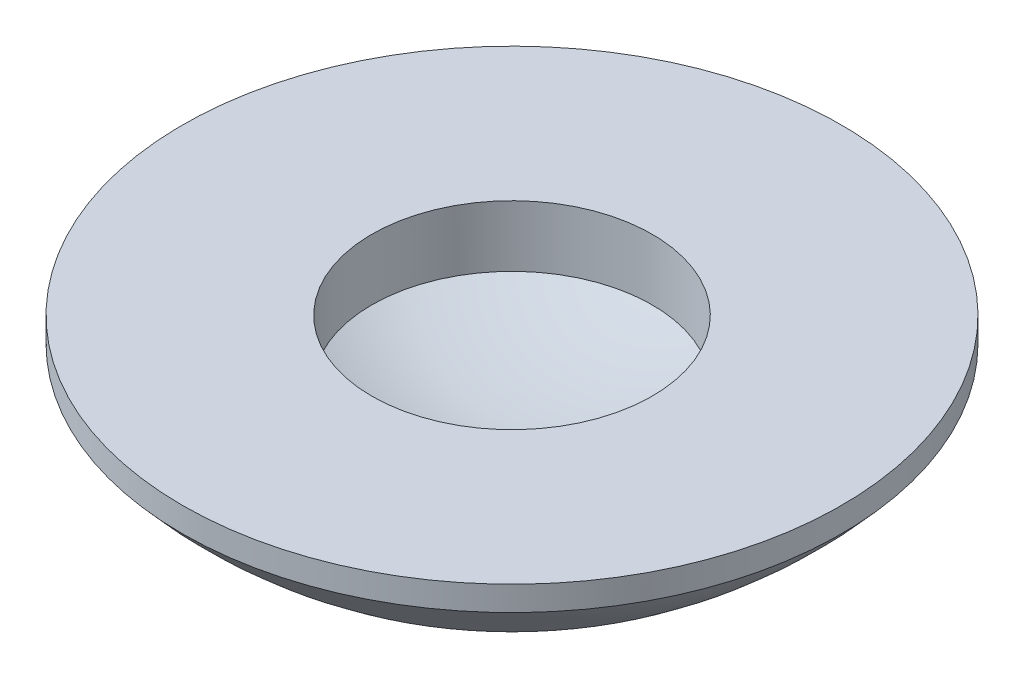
ISO-10303-21;
HEADER;
FILE_DESCRIPTION(('STEP AP214'),'2;1');
FILE_NAME('part.step','',(''),(''),'','','');
FILE_SCHEMA(('AUTOMOTIVE_DESIGN { 1 0 10303 214 1 1 1 1 }'));
ENDSEC;
DATA;
#1=APPLICATION_CONTEXT('core data for automotive mechanical design processes');
#2=APPLICATION_PROTOCOL_DEFINITION('international standard','automotive_design',2000,#1);
#3=PRODUCT_CONTEXT('',#1,'mechanical');
#4=PRODUCT('Part','Part','',(#3));
#5=PRODUCT_RELATED_PRODUCT_CATEGORY('part','',(#4));
#6=PRODUCT_DEFINITION_FORMATION('','',#4);
#7=PRODUCT_DEFINITION_CONTEXT('part definition',#1,'design');
#8=PRODUCT_DEFINITION('design','',#6,#7);
#9=PRODUCT_DEFINITION_SHAPE('','',#8);
#10=(LENGTH_UNIT() NAMED_UNIT(*) SI_UNIT(.MILLI.,.METRE.));
#11=(NAMED_UNIT(*) PLANE_ANGLE_UNIT() SI_UNIT($,.RADIAN.));
#12=(NAMED_UNIT(*) SI_UNIT($,.STERADIAN.) SOLID_ANGLE_UNIT());
#13=UNCERTAINTY_MEASURE_WITH_UNIT(LENGTH_MEASURE(1.E-05),#10,'distance_accuracy_value','');
#14=(GEOMETRIC_REPRESENTATION_CONTEXT(3) GLOBAL_UNCERTAINTY_ASSIGNED_CONTEXT((#13)) GLOBAL_UNIT_ASSIGNED_CONTEXT((#10,
#11,#12)) REPRESENTATION_CONTEXT('',''));
#15=CARTESIAN_POINT('',(0.,0.,0.));
#16=DIRECTION('',(0.,0.,1.));
#17=DIRECTION('',(1.,0.,0.));
#18=AXIS2_PLACEMENT_3D('',#15,#16,#17);
#19=CARTESIAN_POINT('',(0.,-0.407325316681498,0.));
#20=DIRECTION('',(0.,1.,0.));
#21=DIRECTION('',(-1.,0.,0.));
#22=AXIS2_PLACEMENT_3D('',#19,#20,#21);
#23=SPHERICAL_SURFACE('',#22,1.2);
#24=CARTESIAN_POINT('',(0.,-1.50399086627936,0.));
#25=DIRECTION('',(0.,1.,0.));
#26=DIRECTION('',(0.,0.,1.));
#27=AXIS2_PLACEMENT_3D('',#24,#25,#26);
#28=CIRCLE('',#27,0.487159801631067);
#29=CARTESIAN_POINT('',(0.,-1.50399086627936,0.487159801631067));
#30=VERTEX_POINT('',#29);
#31=EDGE_CURVE('E10',#30,#30,#28,.T.);
#32=ORIENTED_EDGE('',*,*,#31,.T.);
#33=EDGE_LOOP('',(#32));
#34=FACE_BOUND('',#33,.T.);
#35=ADVANCED_FACE('F33',(#34),#23,.F.);
#36=CARTESIAN_POINT('',(0.,-1.6073253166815,0.));
#37=DIRECTION('',(0.,1.,0.));
#38=DIRECTION('',(0.,0.,1.));
#39=AXIS2_PLACEMENT_3D('',#36,#37,#38);
#40=CYLINDRICAL_SURFACE('',#39,0.487159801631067);
#41=CARTESIAN_POINT('',(0.,-1.29144887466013,0.));
#42=DIRECTION('',(0.,1.,0.));
#43=DIRECTION('',(0.,0.,1.));
#44=AXIS2_PLACEMENT_3D('',#41,#42,#43);
#45=CIRCLE('',#44,0.487159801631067);
#46=CARTESIAN_POINT('',(0.,-1.29144887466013,0.487159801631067));
#47=VERTEX_POINT('',#46);
#48=EDGE_CURVE('E39',#47,#47,#45,.T.);
#49=ORIENTED_EDGE('',*,*,#48,.T.);
#50=EDGE_LOOP('',(#49));
#51=FACE_BOUND('',#50,.T.);
#52=ORIENTED_EDGE('',*,*,#31,.F.);
#53=EDGE_LOOP('',(#52));
#54=FACE_BOUND('',#53,.T.);
#55=ADVANCED_FACE('F65',(#51,#54),#40,.F.);
#56=CARTESIAN_POINT('',(-0.487159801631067,-1.29144887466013,0.));
#57=DIRECTION('',(0.,1.,0.));
#58=DIRECTION('',(0.,0.,1.));
#59=AXIS2_PLACEMENT_3D('',#56,#57,#58);
#60=PLANE('',#59);
#61=CARTESIAN_POINT('',(0.,-1.29144887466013,0.));
#62=DIRECTION('',(0.,1.,0.));
#63=DIRECTION('',(0.,0.,1.));
#64=AXIS2_PLACEMENT_3D('',#61,#62,#63);
#65=CIRCLE('',#64,1.14460018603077);
#66=CARTESIAN_POINT('',(0.,-1.29144887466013,1.14460018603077));
#67=VERTEX_POINT('',#66);
#68=EDGE_CURVE('E43',#67,#67,#65,.T.);
#69=ORIENTED_EDGE('',*,*,#68,.T.);
#70=EDGE_LOOP('',(#69));
#71=FACE_BOUND('',#70,.T.);
#72=ORIENTED_EDGE('',*,*,#48,.F.);
#73=EDGE_LOOP('',(#72));
#74=FACE_BOUND('',#73,.T.);
#75=ADVANCED_FACE('F62',(#71,#74),#60,.T.);
#76=CARTESIAN_POINT('',(0.,-1.6073253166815,0.));
#77=DIRECTION('',(0.,1.,0.));
#78=DIRECTION('',(0.,0.,1.));
#79=AXIS2_PLACEMENT_3D('',#76,#77,#78);
#80=CYLINDRICAL_SURFACE('',#79,1.14460018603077);
#81=CARTESIAN_POINT('',(0.,-1.37680477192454,0.));
#82=DIRECTION('',(0.,1.,0.));
#83=DIRECTION('',(0.,0.,1.));
#84=AXIS2_PLACEMENT_3D('',#81,#82,#83);
#85=CIRCLE('',#84,1.14460018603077);
#86=CARTESIAN_POINT('',(0.,-1.37680477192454,1.14460018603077));
#87=VERTEX_POINT('',#86);
#88=EDGE_CURVE('E47',#87,#87,#85,.T.);
#89=ORIENTED_EDGE('',*,*,#88,.T.);
#90=EDGE_LOOP('',(#89));
#91=FACE_BOUND('',#90,.T.);
#92=ORIENTED_EDGE('',*,*,#68,.F.);
#93=EDGE_LOOP('',(#92));
#94=FACE_BOUND('',#93,.T.);
#95=ADVANCED_FACE('F53',(#91,#94),#80,.T.);
#96=CARTESIAN_POINT('',(0.,-0.407325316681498,0.));
#97=DIRECTION('',(0.,1.,0.));
#98=DIRECTION('',(-1.,0.,0.));
#99=AXIS2_PLACEMENT_3D('',#96,#97,#98);
#100=SPHERICAL_SURFACE('',#99,1.5);
#101=ORIENTED_EDGE('',*,*,#88,.F.);
#102=EDGE_LOOP('',(#101));
#103=FACE_BOUND('',#102,.T.);
#104=ADVANCED_FACE('F56',(#103),#100,.T.);
#105=CLOSED_SHELL('',(#35,#55,#75,#95,#104));
#106=MANIFOLD_SOLID_BREP('B2',#105);
#107=ADVANCED_BREP_SHAPE_REPRESENTATION('',(#18,#106),#14);
#108=SHAPE_DEFINITION_REPRESENTATION(#9,#107);
ENDSEC;
END-ISO-10303-21;
